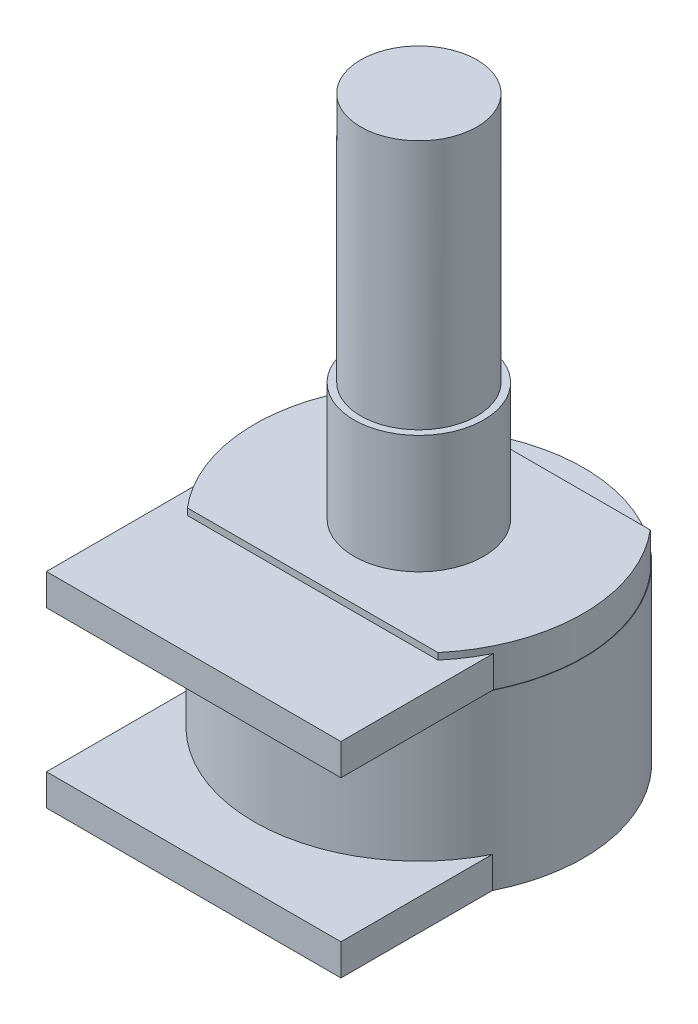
from build123d import *

# Parameters (mm, degrees)
SKETCH1_R           = 3
BOSS_EXTRUDE1_DEPTH = 12.92
SKETCH2_R           = 3.35
BOSS_EXTRUDE2_DEPTH = 6.1
SKETCH3_R           = 8.475
BOSS_EXTRUDE3_DEPTH = 1.96
SKETCH4_OUTSIDE_W   = 25.322
SKETCH4_OUTSIDE_H   = 25.322
SKETCH4_OUTSIDE_W_2 = 23.743248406
SKETCH4_OUTSIDE_H_2 = 10.96
CUT_EXTRUDE1_DEPTH  = 1.96
SKETCH5_R           = 8.5
BOSS_EXTRUDE4_DEPTH = 8.95
SKETCH6_W           = 15.2
SKETCH6_H           = 11.396660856
BOSS_EXTRUDE5_DEPTH = 1.62


with BuildPart() as part:
    # Sketch1 → Boss-Extrude1 (new body)
    with BuildSketch(Plane(origin=(0, 0, 0), x_dir=(1, 0, 0), z_dir=(0, 1, 0))):
        with Locations(Location((0, 0, 0), (0, 0, 270))):
            Circle(SKETCH1_R)
    extrude(amount=BOSS_EXTRUDE1_DEPTH)

    # Sketch2 → Boss-Extrude2 (add)
    with BuildSketch(Plane.XZ):
        with Locations(Location((0, 0, 0), (0, 0, 270))):
            Circle(SKETCH2_R)
    extrude(amount=BOSS_EXTRUDE2_DEPTH)

    # Sketch3 → Boss-Extrude3 (add)
    with BuildSketch(Plane.XZ.offset(6.1)):
        with Locations(Location((0, 0, 0), (0, 0, 270))):
            Circle(SKETCH3_R)
    extrude(amount=BOSS_EXTRUDE3_DEPTH)

    # Sketch4 outside → Cut-Extrude1 (cut)
    with BuildSketch(Plane.XZ.offset(8.06)):
        Rectangle(SKETCH4_OUTSIDE_W, SKETCH4_OUTSIDE_H)
        Rectangle(SKETCH4_OUTSIDE_W_2, SKETCH4_OUTSIDE_H_2, mode=Mode.SUBTRACT)
    extrude(amount=-CUT_EXTRUDE1_DEPTH, mode=Mode.SUBTRACT)

    # Sketch5 → Boss-Extrude4 (add)
    with BuildSketch(Plane.XZ.offset(8.06)):
        with Locations(Location((0, 0, 0), (0, 0, 90))):
            Circle(SKETCH5_R)
    extrude(amount=BOSS_EXTRUDE4_DEPTH)

    # Sketch6 → Boss-Extrude5 (add)
    with BuildSketch(Plane(origin=(0, -8.06, 0), x_dir=(1, 0, 0), z_dir=(0, 1, 0))):
        with Locations((0, -5.921669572)):
            Rectangle(SKETCH6_W, SKETCH6_H)
    boss_extrude5 = extrude(amount=BOSS_EXTRUDE5_DEPTH)

    # Mirror1: Boss-Extrude5 across plane
    add(boss_extrude5.mirror(Plane.ZX.offset(-11.725)))


solid = part.part
